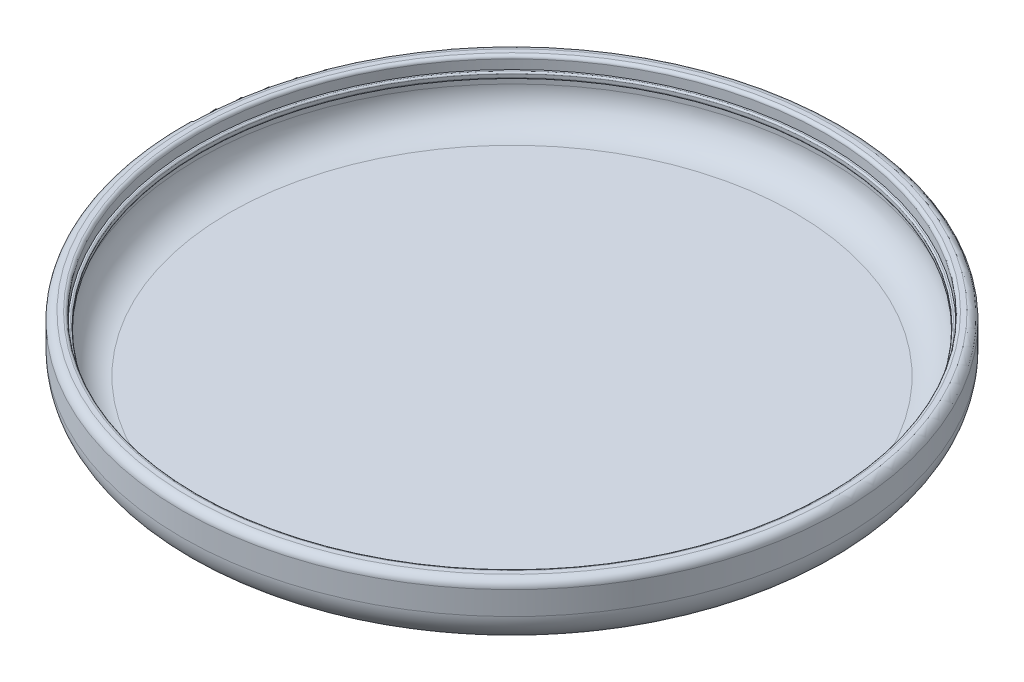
ISO-10303-21;
HEADER;
FILE_DESCRIPTION(('STEP AP214'),'2;1');
FILE_NAME('part.step','',(''),(''),'','','');
FILE_SCHEMA(('AUTOMOTIVE_DESIGN { 1 0 10303 214 1 1 1 1 }'));
ENDSEC;
DATA;
#1=APPLICATION_CONTEXT('core data for automotive mechanical design processes');
#2=APPLICATION_PROTOCOL_DEFINITION('international standard','automotive_design',2000,#1);
#3=PRODUCT_CONTEXT('',#1,'mechanical');
#4=PRODUCT('Part','Part','',(#3));
#5=PRODUCT_RELATED_PRODUCT_CATEGORY('part','',(#4));
#6=PRODUCT_DEFINITION_FORMATION('','',#4);
#7=PRODUCT_DEFINITION_CONTEXT('part definition',#1,'design');
#8=PRODUCT_DEFINITION('design','',#6,#7);
#9=PRODUCT_DEFINITION_SHAPE('','',#8);
#10=(LENGTH_UNIT() NAMED_UNIT(*) SI_UNIT(.MILLI.,.METRE.));
#11=(NAMED_UNIT(*) PLANE_ANGLE_UNIT() SI_UNIT($,.RADIAN.));
#12=(NAMED_UNIT(*) SI_UNIT($,.STERADIAN.) SOLID_ANGLE_UNIT());
#13=UNCERTAINTY_MEASURE_WITH_UNIT(LENGTH_MEASURE(1.E-05),#10,'distance_accuracy_value','');
#14=(GEOMETRIC_REPRESENTATION_CONTEXT(3) GLOBAL_UNCERTAINTY_ASSIGNED_CONTEXT((#13)) GLOBAL_UNIT_ASSIGNED_CONTEXT((#10,
#11,#12)) REPRESENTATION_CONTEXT('',''));
#15=CARTESIAN_POINT('',(0.,0.,0.));
#16=DIRECTION('',(0.,0.,1.));
#17=DIRECTION('',(1.,0.,0.));
#18=AXIS2_PLACEMENT_3D('',#15,#16,#17);
#19=CARTESIAN_POINT('',(0.,0.,0.));
#20=DIRECTION('',(0.,-1.,0.));
#21=DIRECTION('',(0.,0.,-1.));
#22=AXIS2_PLACEMENT_3D('',#19,#20,#21);
#23=PLANE('',#22);
#24=CARTESIAN_POINT('',(0.,0.,0.));
#25=DIRECTION('',(0.,-1.,0.));
#26=DIRECTION('',(0.,0.,-1.));
#27=AXIS2_PLACEMENT_3D('',#24,#25,#26);
#28=CIRCLE('',#27,48.768);
#29=CARTESIAN_POINT('',(0.,0.,-48.768));
#30=VERTEX_POINT('',#29);
#31=EDGE_CURVE('E10',#30,#30,#28,.T.);
#32=ORIENTED_EDGE('',*,*,#31,.T.);
#33=EDGE_LOOP('',(#32));
#34=FACE_BOUND('',#33,.T.);
#35=ADVANCED_FACE('F43',(#34),#23,.T.);
#36=CARTESIAN_POINT('',(0.,5.08,0.));
#37=DIRECTION('',(0.,-1.,0.));
#38=DIRECTION('',(0.,0.,-1.));
#39=AXIS2_PLACEMENT_3D('',#36,#37,#38);
#40=TOROIDAL_SURFACE('',#39,48.768,5.08);
#41=CARTESIAN_POINT('',(0.,5.08,0.));
#42=DIRECTION('',(0.,-1.,0.));
#43=DIRECTION('',(0.,0.,-1.));
#44=AXIS2_PLACEMENT_3D('',#41,#42,#43);
#45=CIRCLE('',#44,53.848);
#46=CARTESIAN_POINT('',(0.,5.08,-53.848));
#47=VERTEX_POINT('',#46);
#48=EDGE_CURVE('E50',#47,#47,#45,.T.);
#49=ORIENTED_EDGE('',*,*,#48,.T.);
#50=EDGE_LOOP('',(#49));
#51=FACE_BOUND('',#50,.T.);
#52=ORIENTED_EDGE('',*,*,#31,.F.);
#53=EDGE_LOOP('',(#52));
#54=FACE_BOUND('',#53,.T.);
#55=ADVANCED_FACE('F119',(#51,#54),#40,.T.);
#56=CARTESIAN_POINT('',(0.,0.,0.));
#57=DIRECTION('',(0.,-1.,0.));
#58=DIRECTION('',(0.,0.,-1.));
#59=AXIS2_PLACEMENT_3D('',#56,#57,#58);
#60=CYLINDRICAL_SURFACE('',#59,53.848);
#61=CARTESIAN_POINT('',(0.,8.88999999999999,0.));
#62=DIRECTION('',(0.,-1.,0.));
#63=DIRECTION('',(0.,0.,-1.));
#64=AXIS2_PLACEMENT_3D('',#61,#62,#63);
#65=CIRCLE('',#64,53.848);
#66=CARTESIAN_POINT('',(0.,8.88999999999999,-53.848));
#67=VERTEX_POINT('',#66);
#68=EDGE_CURVE('E55',#67,#67,#65,.T.);
#69=ORIENTED_EDGE('',*,*,#68,.T.);
#70=EDGE_LOOP('',(#69));
#71=FACE_BOUND('',#70,.T.);
#72=ORIENTED_EDGE('',*,*,#48,.F.);
#73=EDGE_LOOP('',(#72));
#74=FACE_BOUND('',#73,.T.);
#75=ADVANCED_FACE('F123',(#71,#74),#60,.T.);
#76=CARTESIAN_POINT('',(0.,8.89,0.));
#77=DIRECTION('',(0.,-1.,0.));
#78=DIRECTION('',(0.,0.,-1.));
#79=AXIS2_PLACEMENT_3D('',#76,#77,#78);
#80=TOROIDAL_SURFACE('',#79,52.578,1.27);
#81=CARTESIAN_POINT('',(0.,10.16,0.));
#82=DIRECTION('',(0.,-1.,0.));
#83=DIRECTION('',(0.,0.,-1.));
#84=AXIS2_PLACEMENT_3D('',#81,#82,#83);
#85=CIRCLE('',#84,52.578);
#86=CARTESIAN_POINT('',(0.,10.16,-52.578));
#87=VERTEX_POINT('',#86);
#88=EDGE_CURVE('E60',#87,#87,#85,.T.);
#89=ORIENTED_EDGE('',*,*,#88,.T.);
#90=EDGE_LOOP('',(#89));
#91=FACE_BOUND('',#90,.T.);
#92=ORIENTED_EDGE('',*,*,#68,.F.);
#93=EDGE_LOOP('',(#92));
#94=FACE_BOUND('',#93,.T.);
#95=ADVANCED_FACE('F127',(#91,#94),#80,.T.);
#96=CARTESIAN_POINT('',(0.,10.16,-52.578));
#97=DIRECTION('',(0.,1.,0.));
#98=DIRECTION('',(0.,0.,1.));
#99=AXIS2_PLACEMENT_3D('',#96,#97,#98);
#100=PLANE('',#99);
#101=CARTESIAN_POINT('',(0.,10.16,0.));
#102=DIRECTION('',(0.,-1.,0.));
#103=DIRECTION('',(0.,0.,-1.));
#104=AXIS2_PLACEMENT_3D('',#101,#102,#103);
#105=CIRCLE('',#104,51.816);
#106=CARTESIAN_POINT('',(0.,10.16,-51.816));
#107=VERTEX_POINT('',#106);
#108=EDGE_CURVE('E66',#107,#107,#105,.T.);
#109=ORIENTED_EDGE('',*,*,#108,.T.);
#110=EDGE_LOOP('',(#109));
#111=FACE_BOUND('',#110,.T.);
#112=ORIENTED_EDGE('',*,*,#88,.F.);
#113=EDGE_LOOP('',(#112));
#114=FACE_BOUND('',#113,.T.);
#115=ADVANCED_FACE('F134',(#111,#114),#100,.T.);
#116=CARTESIAN_POINT('',(0.,9.652,0.));
#117=DIRECTION('',(0.,-1.,0.));
#118=DIRECTION('',(0.,0.,-1.));
#119=AXIS2_PLACEMENT_3D('',#116,#117,#118);
#120=TOROIDAL_SURFACE('',#119,51.816,0.508000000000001);
#121=CARTESIAN_POINT('',(0.,9.652,0.));
#122=DIRECTION('',(0.,-1.,0.));
#123=DIRECTION('',(0.,0.,-1.));
#124=AXIS2_PLACEMENT_3D('',#121,#122,#123);
#125=CIRCLE('',#124,51.308);
#126=CARTESIAN_POINT('',(0.,9.652,-51.308));
#127=VERTEX_POINT('',#126);
#128=EDGE_CURVE('E70',#127,#127,#125,.T.);
#129=ORIENTED_EDGE('',*,*,#128,.T.);
#130=EDGE_LOOP('',(#129));
#131=FACE_BOUND('',#130,.T.);
#132=ORIENTED_EDGE('',*,*,#108,.F.);
#133=EDGE_LOOP('',(#132));
#134=FACE_BOUND('',#133,.T.);
#135=ADVANCED_FACE('F138',(#131,#134),#120,.T.);
#136=CARTESIAN_POINT('',(0.,0.,0.));
#137=DIRECTION('',(0.,-1.,0.));
#138=DIRECTION('',(0.,0.,-1.));
#139=AXIS2_PLACEMENT_3D('',#136,#137,#138);
#140=CYLINDRICAL_SURFACE('',#139,51.308);
#141=CARTESIAN_POINT('',(0.,8.128,0.));
#142=DIRECTION('',(0.,-1.,0.));
#143=DIRECTION('',(0.,0.,-1.));
#144=AXIS2_PLACEMENT_3D('',#141,#142,#143);
#145=CIRCLE('',#144,51.308);
#146=CARTESIAN_POINT('',(0.,8.128,-51.308));
#147=VERTEX_POINT('',#146);
#148=EDGE_CURVE('E74',#147,#147,#145,.T.);
#149=ORIENTED_EDGE('',*,*,#148,.T.);
#150=EDGE_LOOP('',(#149));
#151=FACE_BOUND('',#150,.T.);
#152=ORIENTED_EDGE('',*,*,#128,.F.);
#153=EDGE_LOOP('',(#152));
#154=FACE_BOUND('',#153,.T.);
#155=ADVANCED_FACE('F142',(#151,#154),#140,.F.);
#156=CARTESIAN_POINT('',(0.,8.128,-51.308));
#157=DIRECTION('',(0.,1.,0.));
#158=DIRECTION('',(0.,0.,1.));
#159=AXIS2_PLACEMENT_3D('',#156,#157,#158);
#160=PLANE('',#159);
#161=CARTESIAN_POINT('',(0.,8.128,0.));
#162=DIRECTION('',(0.,-1.,0.));
#163=DIRECTION('',(0.,0.,-1.));
#164=AXIS2_PLACEMENT_3D('',#161,#162,#163);
#165=CIRCLE('',#164,51.054);
#166=CARTESIAN_POINT('',(0.,8.128,-51.054));
#167=VERTEX_POINT('',#166);
#168=EDGE_CURVE('E78',#167,#167,#165,.T.);
#169=ORIENTED_EDGE('',*,*,#168,.T.);
#170=EDGE_LOOP('',(#169));
#171=FACE_BOUND('',#170,.T.);
#172=ORIENTED_EDGE('',*,*,#148,.F.);
#173=EDGE_LOOP('',(#172));
#174=FACE_BOUND('',#173,.T.);
#175=ADVANCED_FACE('F146',(#171,#174),#160,.T.);
#176=CARTESIAN_POINT('',(0.,7.874,0.));
#177=DIRECTION('',(0.,-1.,0.));
#178=DIRECTION('',(0.,0.,-1.));
#179=AXIS2_PLACEMENT_3D('',#176,#177,#178);
#180=TOROIDAL_SURFACE('',#179,51.054,0.253999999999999);
#181=CARTESIAN_POINT('',(0.,7.874,0.));
#182=DIRECTION('',(0.,-1.,0.));
#183=DIRECTION('',(0.,0.,-1.));
#184=AXIS2_PLACEMENT_3D('',#181,#182,#183);
#185=CIRCLE('',#184,50.8);
#186=CARTESIAN_POINT('',(0.,7.874,-50.8));
#187=VERTEX_POINT('',#186);
#188=EDGE_CURVE('E82',#187,#187,#185,.T.);
#189=ORIENTED_EDGE('',*,*,#188,.T.);
#190=EDGE_LOOP('',(#189));
#191=FACE_BOUND('',#190,.T.);
#192=ORIENTED_EDGE('',*,*,#168,.F.);
#193=EDGE_LOOP('',(#192));
#194=FACE_BOUND('',#193,.T.);
#195=ADVANCED_FACE('F150',(#191,#194),#180,.T.);
#196=CARTESIAN_POINT('',(0.,0.,0.));
#197=DIRECTION('',(0.,-1.,0.));
#198=DIRECTION('',(0.,0.,-1.));
#199=AXIS2_PLACEMENT_3D('',#196,#197,#198);
#200=CYLINDRICAL_SURFACE('',#199,50.8);
#201=CARTESIAN_POINT('',(0.,7.366,0.));
#202=DIRECTION('',(0.,-1.,0.));
#203=DIRECTION('',(0.,0.,-1.));
#204=AXIS2_PLACEMENT_3D('',#201,#202,#203);
#205=CIRCLE('',#204,50.8);
#206=CARTESIAN_POINT('',(0.,7.366,-50.8));
#207=VERTEX_POINT('',#206);
#208=EDGE_CURVE('E86',#207,#207,#205,.T.);
#209=ORIENTED_EDGE('',*,*,#208,.T.);
#210=EDGE_LOOP('',(#209));
#211=FACE_BOUND('',#210,.T.);
#212=ORIENTED_EDGE('',*,*,#188,.F.);
#213=EDGE_LOOP('',(#212));
#214=FACE_BOUND('',#213,.T.);
#215=ADVANCED_FACE('F154',(#211,#214),#200,.F.);
#216=CARTESIAN_POINT('',(0.,7.366,0.));
#217=DIRECTION('',(0.,-1.,0.));
#218=DIRECTION('',(0.,0.,-1.));
#219=AXIS2_PLACEMENT_3D('',#216,#217,#218);
#220=TOROIDAL_SURFACE('',#219,51.054,0.253999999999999);
#221=CARTESIAN_POINT('',(0.,7.112,0.));
#222=DIRECTION('',(0.,-1.,0.));
#223=DIRECTION('',(0.,0.,-1.));
#224=AXIS2_PLACEMENT_3D('',#221,#222,#223);
#225=CIRCLE('',#224,51.054);
#226=CARTESIAN_POINT('',(0.,7.112,-51.054));
#227=VERTEX_POINT('',#226);
#228=EDGE_CURVE('E90',#227,#227,#225,.T.);
#229=ORIENTED_EDGE('',*,*,#228,.T.);
#230=EDGE_LOOP('',(#229));
#231=FACE_BOUND('',#230,.T.);
#232=ORIENTED_EDGE('',*,*,#208,.F.);
#233=EDGE_LOOP('',(#232));
#234=FACE_BOUND('',#233,.T.);
#235=ADVANCED_FACE('F158',(#231,#234),#220,.T.);
#236=CARTESIAN_POINT('',(0.,7.112,-51.308));
#237=DIRECTION('',(0.,-1.,0.));
#238=DIRECTION('',(0.,0.,-1.));
#239=AXIS2_PLACEMENT_3D('',#236,#237,#238);
#240=PLANE('',#239);
#241=CARTESIAN_POINT('',(0.,7.112,0.));
#242=DIRECTION('',(0.,-1.,0.));
#243=DIRECTION('',(0.,0.,-1.));
#244=AXIS2_PLACEMENT_3D('',#241,#242,#243);
#245=CIRCLE('',#244,51.308);
#246=CARTESIAN_POINT('',(0.,7.112,-51.308));
#247=VERTEX_POINT('',#246);
#248=EDGE_CURVE('E94',#247,#247,#245,.T.);
#249=ORIENTED_EDGE('',*,*,#248,.T.);
#250=EDGE_LOOP('',(#249));
#251=FACE_BOUND('',#250,.T.);
#252=ORIENTED_EDGE('',*,*,#228,.F.);
#253=EDGE_LOOP('',(#252));
#254=FACE_BOUND('',#253,.T.);
#255=ADVANCED_FACE('F162',(#251,#254),#240,.T.);
#256=CARTESIAN_POINT('',(0.,0.,0.));
#257=DIRECTION('',(0.,-1.,0.));
#258=DIRECTION('',(0.,0.,-1.));
#259=AXIS2_PLACEMENT_3D('',#256,#257,#258);
#260=CYLINDRICAL_SURFACE('',#259,51.308);
#261=CARTESIAN_POINT('',(0.,6.09600000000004,0.));
#262=DIRECTION('',(0.,-1.,0.));
#263=DIRECTION('',(0.,0.,-1.));
#264=AXIS2_PLACEMENT_3D('',#261,#262,#263);
#265=CIRCLE('',#264,51.308);
#266=CARTESIAN_POINT('',(0.,6.09600000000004,-51.308));
#267=VERTEX_POINT('',#266);
#268=EDGE_CURVE('E98',#267,#267,#265,.T.);
#269=ORIENTED_EDGE('',*,*,#268,.T.);
#270=EDGE_LOOP('',(#269));
#271=FACE_BOUND('',#270,.T.);
#272=ORIENTED_EDGE('',*,*,#248,.F.);
#273=EDGE_LOOP('',(#272));
#274=FACE_BOUND('',#273,.T.);
#275=ADVANCED_FACE('F116',(#271,#274),#260,.F.);
#276=CARTESIAN_POINT('',(0.,6.096,0.));
#277=DIRECTION('',(0.,-1.,0.));
#278=DIRECTION('',(0.,0.,-1.));
#279=AXIS2_PLACEMENT_3D('',#276,#277,#278);
#280=TOROIDAL_SURFACE('',#279,46.228,5.08);
#281=CARTESIAN_POINT('',(0.,1.016,0.));
#282=DIRECTION('',(0.,-1.,0.));
#283=DIRECTION('',(0.,0.,-1.));
#284=AXIS2_PLACEMENT_3D('',#281,#282,#283);
#285=CIRCLE('',#284,46.228);
#286=CARTESIAN_POINT('',(0.,1.016,-46.228));
#287=VERTEX_POINT('',#286);
#288=EDGE_CURVE('E102',#287,#287,#285,.T.);
#289=ORIENTED_EDGE('',*,*,#288,.T.);
#290=EDGE_LOOP('',(#289));
#291=FACE_BOUND('',#290,.T.);
#292=ORIENTED_EDGE('',*,*,#268,.F.);
#293=EDGE_LOOP('',(#292));
#294=FACE_BOUND('',#293,.T.);
#295=ADVANCED_FACE('F107',(#291,#294),#280,.F.);
#296=CARTESIAN_POINT('',(0.,1.016,0.));
#297=DIRECTION('',(0.,1.,0.));
#298=DIRECTION('',(0.,0.,1.));
#299=AXIS2_PLACEMENT_3D('',#296,#297,#298);
#300=PLANE('',#299);
#301=ORIENTED_EDGE('',*,*,#288,.F.);
#302=EDGE_LOOP('',(#301));
#303=FACE_BOUND('',#302,.T.);
#304=ADVANCED_FACE('F110',(#303),#300,.T.);
#305=CLOSED_SHELL('',(#35,#55,#75,#95,#115,#135,#155,#175,#195,#215,#235,#255,#275,#295,#304));
#306=MANIFOLD_SOLID_BREP('B2',#305);
#307=ADVANCED_BREP_SHAPE_REPRESENTATION('',(#18,#306),#14);
#308=SHAPE_DEFINITION_REPRESENTATION(#9,#307);
ENDSEC;
END-ISO-10303-21;
